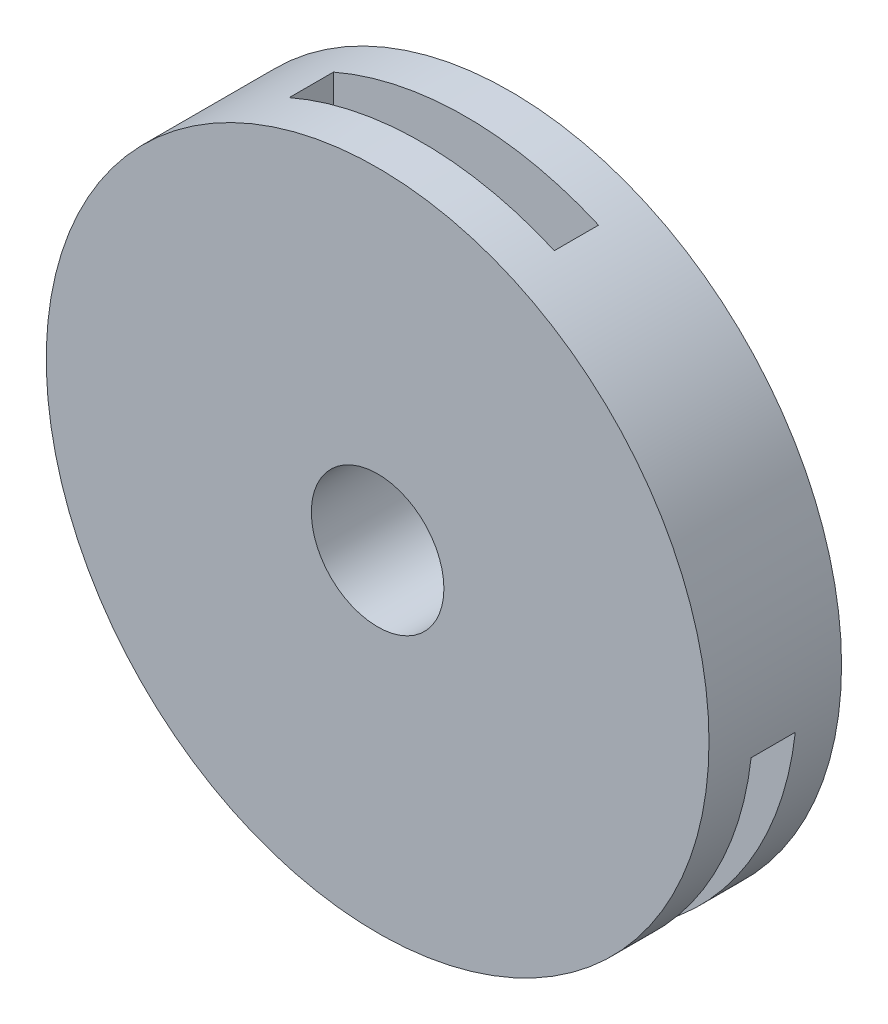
from build123d import *

# Parameters (mm, degrees)
CROQUIS1_R                 = 75
SALIENTE_EXTRUIR1_DEPTH    = 30
CORTAR_EXTRUIR2_REACH      = 142.535
CORTAR_EXTRUIR2_END_RADIUS = 75
MATRIZC2_COUNT             = 3
CROQUIS9_R                 = 15
CORTAR_EXTRUIR4_DEPTH      = 30


with BuildPart() as part:
    # Croquis1 → Saliente-Extruir1 (new body)
    with BuildSketch(Plane.XY):
        Circle(CROQUIS1_R)
    extrude(amount=SALIENTE_EXTRUIR1_DEPTH)

    # Cortar-Extruir2: up to this cylinder (the profile starts inside it)
    cortar_extruir2_end = Plane(origin=(0, 0, 15), z_dir=(0, 0, -1)) * Cylinder(CORTAR_EXTRUIR2_END_RADIUS, 436.07, mode=Mode.PRIVATE)
    # Croquis5 → Cortar-Extruir2 (cut, up to the surface)
    with BuildSketch(Plane(origin=(0, 40, 0), x_dir=(-1, 0, 0), z_dir=(0, 1, 0)), mode=Mode.PRIVATE) as cortar_extruir2_sk1:
        Polygon((0, 10), (30, 10), (30, 20), (-30, 20), (-30, 10), align=None)
    cortar_extruir2_tool1 = extrude(cortar_extruir2_sk1.sketch, amount=CORTAR_EXTRUIR2_REACH, mode=Mode.PRIVATE) & cortar_extruir2_end
    cortar_extruir2 = cortar_extruir2_tool1.solids().sort_by_distance((0, 40, 15))[0]
    add(cortar_extruir2, mode=Mode.SUBTRACT)

    # MatrizC2: Cortar-Extruir2 ×3 about axis
    matrizc2_axis = Axis((0, 0, 0), (0, 0, 1))
    for i in range(1, MATRIZC2_COUNT):
        add(cortar_extruir2.rotate(matrizc2_axis, i * 360 / MATRIZC2_COUNT), mode=Mode.SUBTRACT)

    # Croquis9 → Cortar-Extruir4 (cut)
    with BuildSketch(Plane.XY.offset(30)):
        Circle(CROQUIS9_R)
    extrude(amount=-CORTAR_EXTRUIR4_DEPTH, mode=Mode.SUBTRACT)


solid = part.part
